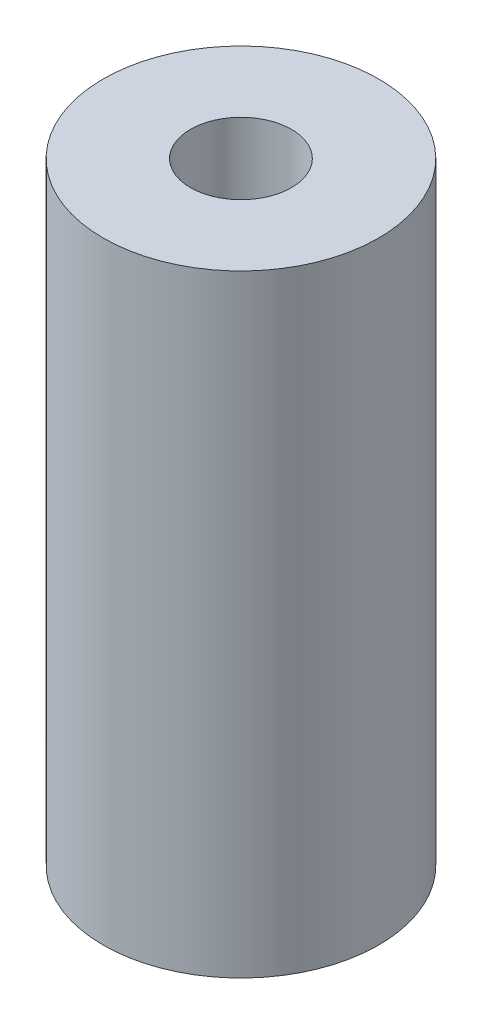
ISO-10303-21;
HEADER;
FILE_DESCRIPTION(('STEP AP214'),'2;1');
FILE_NAME('part.step','',(''),(''),'','','');
FILE_SCHEMA(('AUTOMOTIVE_DESIGN { 1 0 10303 214 1 1 1 1 }'));
ENDSEC;
DATA;
#1=APPLICATION_CONTEXT('core data for automotive mechanical design processes');
#2=APPLICATION_PROTOCOL_DEFINITION('international standard','automotive_design',2000,#1);
#3=PRODUCT_CONTEXT('',#1,'mechanical');
#4=PRODUCT('Part','Part','',(#3));
#5=PRODUCT_RELATED_PRODUCT_CATEGORY('part','',(#4));
#6=PRODUCT_DEFINITION_FORMATION('','',#4);
#7=PRODUCT_DEFINITION_CONTEXT('part definition',#1,'design');
#8=PRODUCT_DEFINITION('design','',#6,#7);
#9=PRODUCT_DEFINITION_SHAPE('','',#8);
#10=(LENGTH_UNIT() NAMED_UNIT(*) SI_UNIT(.MILLI.,.METRE.));
#11=(NAMED_UNIT(*) PLANE_ANGLE_UNIT() SI_UNIT($,.RADIAN.));
#12=(NAMED_UNIT(*) SI_UNIT($,.STERADIAN.) SOLID_ANGLE_UNIT());
#13=UNCERTAINTY_MEASURE_WITH_UNIT(LENGTH_MEASURE(1.E-05),#10,'distance_accuracy_value','');
#14=(GEOMETRIC_REPRESENTATION_CONTEXT(3) GLOBAL_UNCERTAINTY_ASSIGNED_CONTEXT((#13)) GLOBAL_UNIT_ASSIGNED_CONTEXT((#10,
#11,#12)) REPRESENTATION_CONTEXT('',''));
#15=CARTESIAN_POINT('',(0.,0.,0.));
#16=DIRECTION('',(0.,0.,1.));
#17=DIRECTION('',(1.,0.,0.));
#18=AXIS2_PLACEMENT_3D('',#15,#16,#17);
#19=CARTESIAN_POINT('',(0.,40.,0.));
#20=DIRECTION('',(0.,1.,0.));
#21=DIRECTION('',(0.,0.,1.));
#22=AXIS2_PLACEMENT_3D('',#19,#20,#21);
#23=PLANE('',#22);
#24=CARTESIAN_POINT('',(0.,40.,0.));
#25=DIRECTION('',(0.,1.,0.));
#26=DIRECTION('',(0.,0.,1.));
#27=AXIS2_PLACEMENT_3D('',#24,#25,#26);
#28=CIRCLE('',#27,9.);
#29=CARTESIAN_POINT('',(0.,40.,9.));
#30=VERTEX_POINT('',#29);
#31=EDGE_CURVE('E10',#30,#30,#28,.T.);
#32=ORIENTED_EDGE('',*,*,#31,.T.);
#33=EDGE_LOOP('',(#32));
#34=FACE_BOUND('',#33,.T.);
#35=CARTESIAN_POINT('',(0.,40.,0.));
#36=DIRECTION('',(0.,1.,0.));
#37=DIRECTION('',(0.,0.,1.));
#38=AXIS2_PLACEMENT_3D('',#35,#36,#37);
#39=CIRCLE('',#38,3.3);
#40=CARTESIAN_POINT('',(0.,40.,3.3));
#41=VERTEX_POINT('',#40);
#42=EDGE_CURVE('E46',#41,#41,#39,.T.);
#43=ORIENTED_EDGE('',*,*,#42,.F.);
#44=EDGE_LOOP('',(#43));
#45=FACE_BOUND('',#44,.T.);
#46=ADVANCED_FACE('F35',(#34,#45),#23,.T.);
#47=CARTESIAN_POINT('',(0.,0.,0.));
#48=DIRECTION('',(0.,1.,0.));
#49=DIRECTION('',(0.,0.,1.));
#50=AXIS2_PLACEMENT_3D('',#47,#48,#49);
#51=PLANE('',#50);
#52=CARTESIAN_POINT('',(0.,0.,0.));
#53=DIRECTION('',(0.,1.,0.));
#54=DIRECTION('',(0.,0.,1.));
#55=AXIS2_PLACEMENT_3D('',#52,#53,#54);
#56=CIRCLE('',#55,9.);
#57=CARTESIAN_POINT('',(0.,0.,9.));
#58=VERTEX_POINT('',#57);
#59=EDGE_CURVE('E39',#58,#58,#56,.T.);
#60=ORIENTED_EDGE('',*,*,#59,.F.);
#61=EDGE_LOOP('',(#60));
#62=FACE_BOUND('',#61,.T.);
#63=CARTESIAN_POINT('',(0.,0.,0.));
#64=DIRECTION('',(0.,1.,0.));
#65=DIRECTION('',(0.,0.,1.));
#66=AXIS2_PLACEMENT_3D('',#63,#64,#65);
#67=CIRCLE('',#66,3.3);
#68=CARTESIAN_POINT('',(0.,0.,3.3));
#69=VERTEX_POINT('',#68);
#70=EDGE_CURVE('E48',#69,#69,#67,.T.);
#71=ORIENTED_EDGE('',*,*,#70,.T.);
#72=EDGE_LOOP('',(#71));
#73=FACE_BOUND('',#72,.T.);
#74=ADVANCED_FACE('F58',(#62,#73),#51,.F.);
#75=CARTESIAN_POINT('',(0.,40.,0.));
#76=DIRECTION('',(0.,-1.,0.));
#77=DIRECTION('',(0.,0.,-1.));
#78=AXIS2_PLACEMENT_3D('',#75,#76,#77);
#79=CYLINDRICAL_SURFACE('',#78,9.);
#80=ORIENTED_EDGE('',*,*,#31,.F.);
#81=EDGE_LOOP('',(#80));
#82=FACE_BOUND('',#81,.T.);
#83=ORIENTED_EDGE('',*,*,#59,.T.);
#84=EDGE_LOOP('',(#83));
#85=FACE_BOUND('',#84,.T.);
#86=ADVANCED_FACE('F37',(#82,#85),#79,.T.);
#87=CARTESIAN_POINT('',(0.,40.,0.));
#88=DIRECTION('',(0.,-1.,0.));
#89=DIRECTION('',(0.,0.,-1.));
#90=AXIS2_PLACEMENT_3D('',#87,#88,#89);
#91=CYLINDRICAL_SURFACE('',#90,3.3);
#92=ORIENTED_EDGE('',*,*,#42,.T.);
#93=EDGE_LOOP('',(#92));
#94=FACE_BOUND('',#93,.T.);
#95=ORIENTED_EDGE('',*,*,#70,.F.);
#96=EDGE_LOOP('',(#95));
#97=FACE_BOUND('',#96,.T.);
#98=ADVANCED_FACE('F54',(#94,#97),#91,.F.);
#99=CLOSED_SHELL('',(#46,#74,#86,#98));
#100=MANIFOLD_SOLID_BREP('B2',#99);
#101=ADVANCED_BREP_SHAPE_REPRESENTATION('',(#18,#100),#14);
#102=SHAPE_DEFINITION_REPRESENTATION(#9,#101);
ENDSEC;
END-ISO-10303-21;
